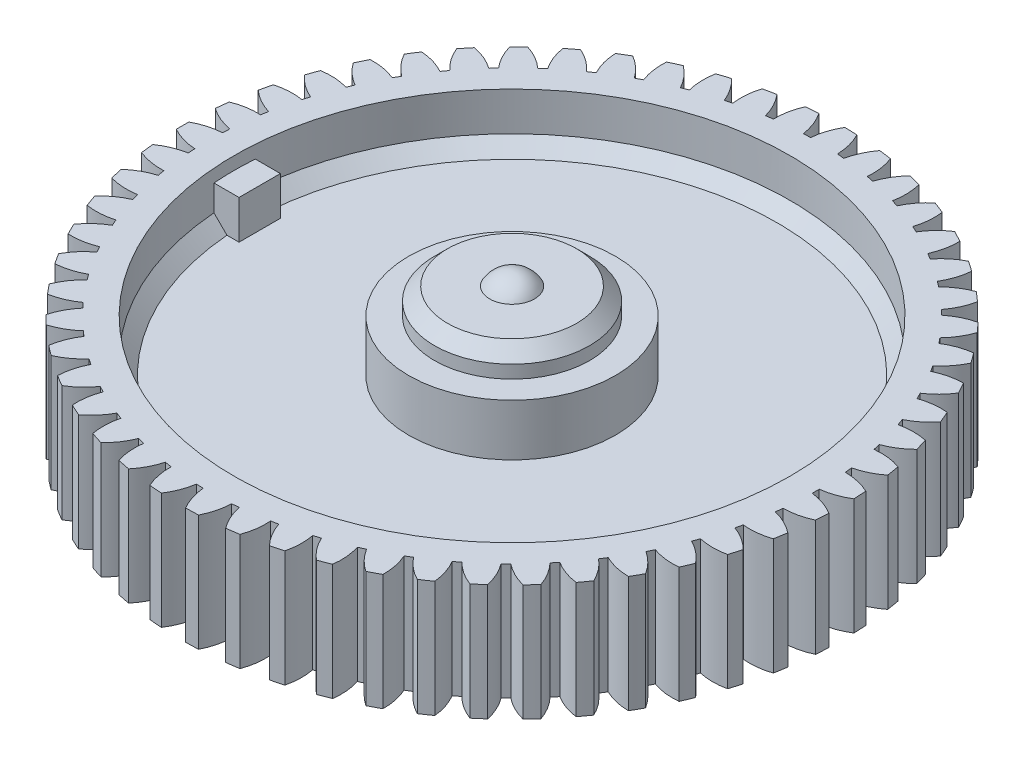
from build123d import *

# Parameters (mm, degrees)
ENL_V_MAT_EXTRU_1_DEPTH      = 41.031237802
R_P_TITION_CIRCULAIRE1_COUNT = 55
BOSS_EXTRU_1_START           = 3
BOSS_EXTRU_1_DEPTH           = 3


with BuildPart() as part:
    # Esquisse1 → Base-R_volution (revolve)
    with BuildSketch(Plane.XY):
        with BuildLine():
            Line((1.732050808, 16), (5, 16))
            Line((5, 16), (6, 15))
            Line((6, 15), (6, 14))
            Line((6, 14), (8, 14))
            Line((8, 14), (8, 10))
            Line((8, 10), (20.5, 10))
            Line((20.5, 10), (21.5, 11))
            Line((21.5, 11), (21.5, 14))
            Line((21.5, 14), (25.5, 14))
            Line((25.5, 14), (25.5, 5))
            Line((25.5, 5), (8, 5))
            Line((8, 5), (8, 0))
            Line((8, 0), (4, 0))
            Line((4, 0), (4, 14))
            Line((4, 14), (0, 14))
            Line((0, 14), (0, 17))
            ThreePointArc((0, 17), (1, 16.732050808), (1.732050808, 16))
        make_face()
    revolve(axis=Axis((0, 12.5, 0), (0, 1, 0)))

    # Esquisse2 → Enl_v. mat.-Extru.1 (cut, through all)
    with BuildSketch(Plane(origin=(-2, 14, 0), x_dir=(-1, 0, 0), z_dir=(0, 1, 0))):
        with BuildLine():
            ThreePointArc((-27.973390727, 1.318867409), (-28.008191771, 0), (-27.973390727, -1.318867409))
            ThreePointArc((-27.973390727, -1.318867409), (-26.810109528, -0.619205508), (-25.498581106, -0.26900111))
            ThreePointArc((-25.498581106, -0.26900111), (-25.500189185, 0), (-25.498581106, 0.26900111))
            ThreePointArc((-25.498581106, 0.26900111), (-26.810109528, 0.619205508), (-27.973390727, 1.318867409))
        make_face()
    enl_v_mat_extru_1 = extrude(amount=-ENL_V_MAT_EXTRU_1_DEPTH, mode=Mode.SUBTRACT)

    # R_p_tition circulaire1: Enl_v. mat.-Extru.1 ×55 about axis
    r_p_tition_circulaire1_axis = Axis((0, 12.5, 0), (0, 1, 0))
    for i in range(1, R_P_TITION_CIRCULAIRE1_COUNT):
        add(enl_v_mat_extru_1.rotate(r_p_tition_circulaire1_axis, i * 360 / R_P_TITION_CIRCULAIRE1_COUNT), mode=Mode.SUBTRACT)

    # Esquisse3 → Boss.-Extru.1 (add)
    with BuildSketch(Plane(origin=(0, 10, 0), x_dir=(-1, 0, 0), z_dir=(0, 1, 0)).offset(BOSS_EXTRU_1_START)):
        with BuildLine():
            Line((19.5, 1.626267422), (21.438406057, 1.626267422))
            ThreePointArc((21.438406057, 1.626267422), (21.499983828, 0.026369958), (21.442330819, -1.573673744))
            Line((21.442330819, -1.573673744), (19.5, -1.573673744))
            Line((19.5, -1.573673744), (19.5, 1.626267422))
        make_face()
    extrude(amount=-BOSS_EXTRU_1_DEPTH)


solid = part.part
